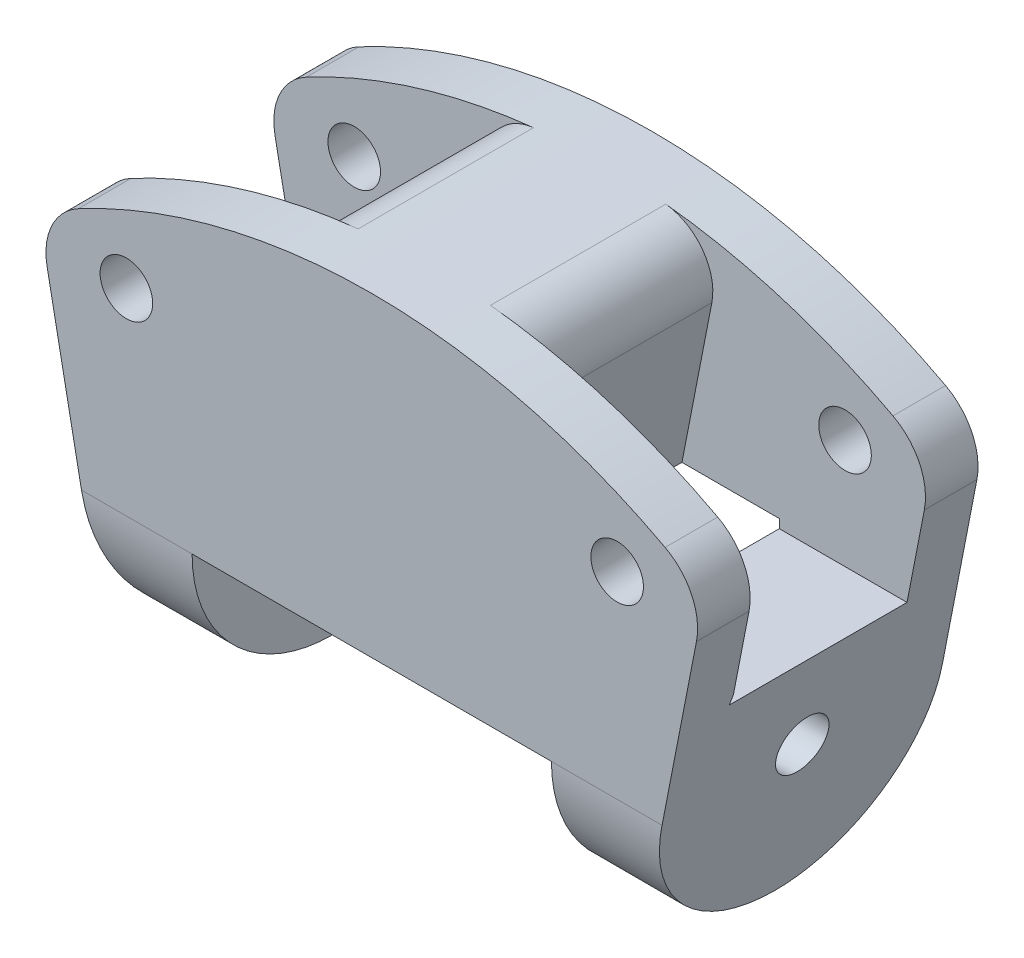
ISO-10303-21;
HEADER;
FILE_DESCRIPTION(('STEP AP214'),'2;1');
FILE_NAME('part.step','',(''),(''),'','','');
FILE_SCHEMA(('AUTOMOTIVE_DESIGN { 1 0 10303 214 1 1 1 1 }'));
ENDSEC;
DATA;
#1=APPLICATION_CONTEXT('core data for automotive mechanical design processes');
#2=APPLICATION_PROTOCOL_DEFINITION('international standard','automotive_design',2000,#1);
#3=PRODUCT_CONTEXT('',#1,'mechanical');
#4=PRODUCT('Part','Part','',(#3));
#5=PRODUCT_RELATED_PRODUCT_CATEGORY('part','',(#4));
#6=PRODUCT_DEFINITION_FORMATION('','',#4);
#7=PRODUCT_DEFINITION_CONTEXT('part definition',#1,'design');
#8=PRODUCT_DEFINITION('design','',#6,#7);
#9=PRODUCT_DEFINITION_SHAPE('','',#8);
#10=(LENGTH_UNIT() NAMED_UNIT(*) SI_UNIT(.MILLI.,.METRE.));
#11=(NAMED_UNIT(*) PLANE_ANGLE_UNIT() SI_UNIT($,.RADIAN.));
#12=(NAMED_UNIT(*) SI_UNIT($,.STERADIAN.) SOLID_ANGLE_UNIT());
#13=UNCERTAINTY_MEASURE_WITH_UNIT(LENGTH_MEASURE(1.E-05),#10,'distance_accuracy_value','');
#14=(GEOMETRIC_REPRESENTATION_CONTEXT(3) GLOBAL_UNCERTAINTY_ASSIGNED_CONTEXT((#13)) GLOBAL_UNIT_ASSIGNED_CONTEXT((#10,
#11,#12)) REPRESENTATION_CONTEXT('',''));
#15=CARTESIAN_POINT('',(0.,0.,0.));
#16=DIRECTION('',(0.,0.,1.));
#17=DIRECTION('',(1.,0.,0.));
#18=AXIS2_PLACEMENT_3D('',#15,#16,#17);
#19=CARTESIAN_POINT('',(0.,-9.5681818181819,5.));
#20=DIRECTION('',(0.,0.,1.));
#21=DIRECTION('',(1.,0.,0.));
#22=AXIS2_PLACEMENT_3D('',#19,#20,#21);
#23=PLANE('',#22);
#24=CARTESIAN_POINT('',(14.,19.25,5.));
#25=DIRECTION('',(0.,0.,1.));
#26=DIRECTION('',(1.,0.,0.));
#27=AXIS2_PLACEMENT_3D('',#24,#25,#26);
#28=CIRCLE('',#27,1.5);
#29=CARTESIAN_POINT('',(15.5,19.25,5.));
#30=VERTEX_POINT('',#29);
#31=EDGE_CURVE('E336',#30,#30,#28,.T.);
#32=ORIENTED_EDGE('',*,*,#31,.T.);
#33=EDGE_LOOP('',(#32));
#34=FACE_BOUND('',#33,.T.);
#35=DIRECTION('',(0.191510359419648,0.981490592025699,0.));
#36=VECTOR('',#35,1.);
#37=CARTESIAN_POINT('',(17.5365853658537,13.,5.));
#38=LINE('',#37,#36);
#39=CARTESIAN_POINT('',(17.6341463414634,13.5,5.));
#40=VERTEX_POINT('',#39);
#41=CARTESIAN_POINT('',(18.5235794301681,18.0583445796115,5.));
#42=VERTEX_POINT('',#41);
#43=EDGE_CURVE('E326',#40,#42,#38,.T.);
#44=ORIENTED_EDGE('',*,*,#43,.F.);
#45=DIRECTION('',(-1.,0.,0.));
#46=VECTOR('',#45,1.);
#47=CARTESIAN_POINT('',(0.,13.5000000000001,5.));
#48=LINE('',#47,#46);
#49=CARTESIAN_POINT('',(4.69670636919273,13.5,5.));
#50=VERTEX_POINT('',#49);
#51=EDGE_CURVE('E438',#40,#50,#48,.T.);
#52=ORIENTED_EDGE('',*,*,#51,.T.);
#53=DIRECTION('',(-0.191510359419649,-0.981490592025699,0.));
#54=VECTOR('',#53,1.);
#55=CARTESIAN_POINT('',(7.,25.3043798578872,5.));
#56=LINE('',#55,#54);
#57=CARTESIAN_POINT('',(6.40234187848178,22.2413819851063,5.));
#58=VERTEX_POINT('',#57);
#59=EDGE_CURVE('E317',#58,#50,#56,.T.);
#60=ORIENTED_EDGE('',*,*,#59,.F.);
#61=CARTESIAN_POINT('',(3.45787010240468,22.8159130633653,5.));
#62=DIRECTION('',(0.,0.,1.));
#63=DIRECTION('',(1.,0.,0.));
#64=AXIS2_PLACEMENT_3D('',#61,#62,#63);
#65=CIRCLE('',#64,3.);
#66=CARTESIAN_POINT('',(3.77638988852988,25.7989559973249,5.));
#67=VERTEX_POINT('',#66);
#68=EDGE_CURVE('E45',#58,#67,#65,.T.);
#69=ORIENTED_EDGE('',*,*,#68,.T.);
#70=CARTESIAN_POINT('',(0.,-9.5681818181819,5.));
#71=DIRECTION('',(0.,0.,1.));
#72=DIRECTION('',(1.,0.,0.));
#73=AXIS2_PLACEMENT_3D('',#70,#71,#72);
#74=CIRCLE('',#73,35.5681818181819);
#75=CARTESIAN_POINT('',(16.7351432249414,21.8170143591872,5.));
#76=VERTEX_POINT('',#75);
#77=EDGE_CURVE('E332',#76,#67,#74,.T.);
#78=ORIENTED_EDGE('',*,*,#77,.F.);
#79=CARTESIAN_POINT('',(15.0883623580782,18.7286308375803,5.));
#80=DIRECTION('',(0.,0.,1.));
#81=DIRECTION('',(1.,0.,0.));
#82=AXIS2_PLACEMENT_3D('',#79,#80,#81);
#83=CIRCLE('',#82,3.5);
#84=EDGE_CURVE('E328',#42,#76,#83,.T.);
#85=ORIENTED_EDGE('',*,*,#84,.F.);
#86=EDGE_LOOP('',(#44,#52,#60,#69,#78,#85));
#87=FACE_BOUND('',#86,.T.);
#88=ADVANCED_FACE('F37',(#34,#87),#23,.F.);
#89=CARTESIAN_POINT('',(-15.0883623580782,18.7286308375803,8.));
#90=DIRECTION('',(0.,0.,-1.));
#91=DIRECTION('',(-1.,0.,0.));
#92=AXIS2_PLACEMENT_3D('',#89,#90,#91);
#93=CYLINDRICAL_SURFACE('',#92,3.5);
#94=CARTESIAN_POINT('',(-15.0883623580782,18.7286308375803,5.));
#95=DIRECTION('',(0.,0.,1.));
#96=DIRECTION('',(-1.,0.,0.));
#97=AXIS2_PLACEMENT_3D('',#94,#95,#96);
#98=CIRCLE('',#97,3.5);
#99=CARTESIAN_POINT('',(-16.7351432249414,21.8170143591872,5.));
#100=VERTEX_POINT('',#99);
#101=CARTESIAN_POINT('',(-18.5235794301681,18.0583445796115,5.));
#102=VERTEX_POINT('',#101);
#103=EDGE_CURVE('E304',#100,#102,#98,.T.);
#104=ORIENTED_EDGE('',*,*,#103,.T.);
#105=DIRECTION('',(0.,0.,-1.));
#106=VECTOR('',#105,1.);
#107=CARTESIAN_POINT('',(-18.5235794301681,18.0583445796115,8.));
#108=LINE('',#107,#106);
#109=CARTESIAN_POINT('',(-18.5235794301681,18.0583445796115,8.));
#110=VERTEX_POINT('',#109);
#111=EDGE_CURVE('E391',#110,#102,#108,.T.);
#112=ORIENTED_EDGE('',*,*,#111,.F.);
#113=CARTESIAN_POINT('',(-15.0883623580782,18.7286308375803,8.));
#114=DIRECTION('',(0.,0.,1.));
#115=DIRECTION('',(1.,0.,0.));
#116=AXIS2_PLACEMENT_3D('',#113,#114,#115);
#117=CIRCLE('',#116,3.5);
#118=CARTESIAN_POINT('',(-16.7351432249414,21.8170143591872,8.));
#119=VERTEX_POINT('',#118);
#120=EDGE_CURVE('E375',#119,#110,#117,.T.);
#121=ORIENTED_EDGE('',*,*,#120,.F.);
#122=DIRECTION('',(0.,0.,-1.));
#123=VECTOR('',#122,1.);
#124=CARTESIAN_POINT('',(-16.7351432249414,21.8170143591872,8.));
#125=LINE('',#124,#123);
#126=EDGE_CURVE('E395',#119,#100,#125,.T.);
#127=ORIENTED_EDGE('',*,*,#126,.T.);
#128=EDGE_LOOP('',(#104,#112,#121,#127));
#129=FACE_BOUND('',#128,.T.);
#130=ADVANCED_FACE('F584',(#129),#93,.T.);
#131=CARTESIAN_POINT('',(-14.,19.25,8.));
#132=DIRECTION('',(0.,0.,-1.));
#133=DIRECTION('',(-1.,0.,0.));
#134=AXIS2_PLACEMENT_3D('',#131,#132,#133);
#135=CYLINDRICAL_SURFACE('',#134,1.5);
#136=CARTESIAN_POINT('',(-14.,19.25,8.));
#137=DIRECTION('',(0.,0.,1.));
#138=DIRECTION('',(1.,0.,0.));
#139=AXIS2_PLACEMENT_3D('',#136,#137,#138);
#140=CIRCLE('',#139,1.5);
#141=CARTESIAN_POINT('',(-12.5,19.25,8.));
#142=VERTEX_POINT('',#141);
#143=EDGE_CURVE('E359',#142,#142,#140,.T.);
#144=ORIENTED_EDGE('',*,*,#143,.T.);
#145=EDGE_LOOP('',(#144));
#146=FACE_BOUND('',#145,.T.);
#147=CARTESIAN_POINT('',(-14.,19.25,5.));
#148=DIRECTION('',(0.,0.,-1.));
#149=DIRECTION('',(-1.,0.,0.));
#150=AXIS2_PLACEMENT_3D('',#147,#148,#149);
#151=CIRCLE('',#150,1.5);
#152=CARTESIAN_POINT('',(-15.5,19.25,5.));
#153=VERTEX_POINT('',#152);
#154=EDGE_CURVE('E313',#153,#153,#151,.T.);
#155=ORIENTED_EDGE('',*,*,#154,.T.);
#156=EDGE_LOOP('',(#155));
#157=FACE_BOUND('',#156,.T.);
#158=ADVANCED_FACE('F589',(#146,#157),#135,.F.);
#159=CARTESIAN_POINT('',(15.,0.,8.));
#160=DIRECTION('',(-0.981490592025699,0.191510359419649,0.));
#161=DIRECTION('',(-0.191510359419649,-0.981490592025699,0.));
#162=AXIS2_PLACEMENT_3D('',#159,#160,#161);
#163=PLANE('',#162);
#164=CARTESIAN_POINT('',(16.5609756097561,8.,0.));
#165=DIRECTION('',(-0.981490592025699,0.191510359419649,0.));
#166=DIRECTION('',(-0.191510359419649,-0.981490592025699,0.));
#167=AXIS2_PLACEMENT_3D('',#164,#165,#166);
#168=ELLIPSE('',#167,1.52828770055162,1.5);
#169=CARTESIAN_POINT('',(16.2682926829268,6.5,0.));
#170=VERTEX_POINT('',#169);
#171=EDGE_CURVE('E279',#170,#170,#168,.T.);
#172=ORIENTED_EDGE('',*,*,#171,.T.);
#173=EDGE_LOOP('',(#172));
#174=FACE_BOUND('',#173,.T.);
#175=DIRECTION('',(0.,0.,1.));
#176=VECTOR('',#175,1.);
#177=CARTESIAN_POINT('',(17.5365853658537,13.,-5.));
#178=LINE('',#177,#176);
#179=CARTESIAN_POINT('',(17.5365853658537,13.,-5.));
#180=VERTEX_POINT('',#179);
#181=CARTESIAN_POINT('',(17.5365853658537,13.,5.13636363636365));
#182=VERTEX_POINT('',#181);
#183=EDGE_CURVE('E325',#180,#182,#178,.T.);
#184=ORIENTED_EDGE('',*,*,#183,.T.);
#185=DIRECTION('',(-0.184997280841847,-0.948111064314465,0.258575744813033));
#186=VECTOR('',#185,1.);
#187=CARTESIAN_POINT('',(17.0306354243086,10.4070065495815,5.84354366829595));
#188=LINE('',#187,#186);
#189=EDGE_CURVE('E446',#182,#40,#188,.F.);
#190=ORIENTED_EDGE('',*,*,#189,.T.);
#191=ORIENTED_EDGE('',*,*,#43,.T.);
#192=DIRECTION('',(0.,0.,-1.));
#193=VECTOR('',#192,1.);
#194=CARTESIAN_POINT('',(18.5235794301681,18.0583445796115,8.));
#195=LINE('',#194,#193);
#196=CARTESIAN_POINT('',(18.5235794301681,18.0583445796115,8.));
#197=VERTEX_POINT('',#196);
#198=EDGE_CURVE('E403',#197,#42,#195,.T.);
#199=ORIENTED_EDGE('',*,*,#198,.F.);
#200=DIRECTION('',(0.191510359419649,0.981490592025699,0.));
#201=VECTOR('',#200,1.);
#202=CARTESIAN_POINT('',(15.,0.,8.));
#203=LINE('',#202,#201);
#204=CARTESIAN_POINT('',(16.5609756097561,8.,8.));
#205=VERTEX_POINT('',#204);
#206=EDGE_CURVE('E368',#205,#197,#203,.T.);
#207=ORIENTED_EDGE('',*,*,#206,.F.);
#208=CARTESIAN_POINT('',(16.5609756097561,8.,0.));
#209=DIRECTION('',(-0.981490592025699,0.191510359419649,0.));
#210=DIRECTION('',(-0.191510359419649,-0.981490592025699,0.));
#211=AXIS2_PLACEMENT_3D('',#208,#209,#210);
#212=ELLIPSE('',#211,8.15086773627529,8.);
#213=CARTESIAN_POINT('',(15.,0.,0.));
#214=VERTEX_POINT('',#213);
#215=EDGE_CURVE('E406',#205,#214,#212,.F.);
#216=ORIENTED_EDGE('',*,*,#215,.T.);
#217=CARTESIAN_POINT('',(16.5609756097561,8.,0.));
#218=DIRECTION('',(-0.981490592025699,0.191510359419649,0.));
#219=DIRECTION('',(0.191510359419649,0.981490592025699,0.));
#220=AXIS2_PLACEMENT_3D('',#217,#218,#219);
#221=ELLIPSE('',#220,8.15086773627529,8.);
#222=CARTESIAN_POINT('',(16.5609756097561,8.,-8.));
#223=VERTEX_POINT('',#222);
#224=EDGE_CURVE('E408',#214,#223,#221,.F.);
#225=ORIENTED_EDGE('',*,*,#224,.T.);
#226=DIRECTION('',(0.191510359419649,0.981490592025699,0.));
#227=VECTOR('',#226,1.);
#228=CARTESIAN_POINT('',(15.,0.,-8.));
#229=LINE('',#228,#227);
#230=CARTESIAN_POINT('',(18.5235794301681,18.0583445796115,-8.));
#231=VERTEX_POINT('',#230);
#232=EDGE_CURVE('E380',#223,#231,#229,.T.);
#233=ORIENTED_EDGE('',*,*,#232,.T.);
#234=CARTESIAN_POINT('',(18.5235794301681,18.0583445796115,-5.));
#235=VERTEX_POINT('',#234);
#236=EDGE_CURVE('E402',#235,#231,#195,.T.);
#237=ORIENTED_EDGE('',*,*,#236,.F.);
#238=DIRECTION('',(0.191510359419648,0.981490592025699,0.));
#239=VECTOR('',#238,1.);
#240=CARTESIAN_POINT('',(17.5365853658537,13.,-5.));
#241=LINE('',#240,#239);
#242=EDGE_CURVE('E316',#180,#235,#241,.T.);
#243=ORIENTED_EDGE('',*,*,#242,.F.);
#244=EDGE_LOOP('',(#184,#190,#191,#199,#207,#216,#225,#233,#237,#243));
#245=FACE_BOUND('',#244,.T.);
#246=ADVANCED_FACE('F541',(#174,#245),#163,.F.);
#247=CARTESIAN_POINT('',(15.0883623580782,18.7286308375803,8.));
#248=DIRECTION('',(0.,0.,-1.));
#249=DIRECTION('',(-1.,0.,0.));
#250=AXIS2_PLACEMENT_3D('',#247,#248,#249);
#251=CYLINDRICAL_SURFACE('',#250,3.5);
#252=CARTESIAN_POINT('',(15.0883623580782,18.7286308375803,-5.));
#253=DIRECTION('',(0.,0.,1.));
#254=DIRECTION('',(1.,0.,0.));
#255=AXIS2_PLACEMENT_3D('',#252,#253,#254);
#256=CIRCLE('',#255,3.5);
#257=CARTESIAN_POINT('',(16.7351432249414,21.8170143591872,-5.));
#258=VERTEX_POINT('',#257);
#259=EDGE_CURVE('E319',#235,#258,#256,.T.);
#260=ORIENTED_EDGE('',*,*,#259,.F.);
#261=ORIENTED_EDGE('',*,*,#236,.T.);
#262=CARTESIAN_POINT('',(15.0883623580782,18.7286308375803,-8.));
#263=DIRECTION('',(0.,0.,1.));
#264=DIRECTION('',(1.,0.,0.));
#265=AXIS2_PLACEMENT_3D('',#262,#263,#264);
#266=CIRCLE('',#265,3.5);
#267=CARTESIAN_POINT('',(16.7351432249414,21.8170143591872,-8.));
#268=VERTEX_POINT('',#267);
#269=EDGE_CURVE('E383',#231,#268,#266,.T.);
#270=ORIENTED_EDGE('',*,*,#269,.T.);
#271=DIRECTION('',(0.,0.,-1.));
#272=VECTOR('',#271,1.);
#273=CARTESIAN_POINT('',(16.7351432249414,21.8170143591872,8.));
#274=LINE('',#273,#272);
#275=EDGE_CURVE('E398',#258,#268,#274,.T.);
#276=ORIENTED_EDGE('',*,*,#275,.F.);
#277=EDGE_LOOP('',(#260,#261,#270,#276));
#278=FACE_BOUND('',#277,.T.);
#279=ADVANCED_FACE('F538',(#278),#251,.T.);
#280=CARTESIAN_POINT('',(0.,-9.5681818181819,8.));
#281=DIRECTION('',(0.,0.,-1.));
#282=DIRECTION('',(-1.,0.,0.));
#283=AXIS2_PLACEMENT_3D('',#280,#281,#282);
#284=CYLINDRICAL_SURFACE('',#283,35.5681818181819);
#285=DIRECTION('',(0.,0.,-1.));
#286=VECTOR('',#285,1.);
#287=CARTESIAN_POINT('',(-3.77638988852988,25.7989559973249,8.));
#288=LINE('',#287,#286);
#289=CARTESIAN_POINT('',(-3.77638988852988,25.7989559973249,-5.));
#290=VERTEX_POINT('',#289);
#291=CARTESIAN_POINT('',(-3.77638988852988,25.7989559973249,5.));
#292=VERTEX_POINT('',#291);
#293=EDGE_CURVE('E462',#290,#292,#288,.F.);
#294=ORIENTED_EDGE('',*,*,#293,.T.);
#295=CARTESIAN_POINT('',(0.,-9.5681818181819,5.));
#296=DIRECTION('',(0.,0.,1.));
#297=DIRECTION('',(-1.,0.,0.));
#298=AXIS2_PLACEMENT_3D('',#295,#296,#297);
#299=CIRCLE('',#298,35.5681818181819);
#300=EDGE_CURVE('E286',#292,#100,#299,.T.);
#301=ORIENTED_EDGE('',*,*,#300,.T.);
#302=ORIENTED_EDGE('',*,*,#126,.F.);
#303=CARTESIAN_POINT('',(0.,-9.5681818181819,8.));
#304=DIRECTION('',(0.,0.,1.));
#305=DIRECTION('',(1.,0.,0.));
#306=AXIS2_PLACEMENT_3D('',#303,#304,#305);
#307=CIRCLE('',#306,35.5681818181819);
#308=CARTESIAN_POINT('',(16.7351432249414,21.8170143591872,8.));
#309=VERTEX_POINT('',#308);
#310=EDGE_CURVE('E373',#309,#119,#307,.T.);
#311=ORIENTED_EDGE('',*,*,#310,.F.);
#312=EDGE_CURVE('E399',#309,#76,#274,.T.);
#313=ORIENTED_EDGE('',*,*,#312,.T.);
#314=ORIENTED_EDGE('',*,*,#77,.T.);
#315=DIRECTION('',(0.,0.,-1.));
#316=VECTOR('',#315,1.);
#317=CARTESIAN_POINT('',(3.77638988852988,25.7989559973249,8.));
#318=LINE('',#317,#316);
#319=CARTESIAN_POINT('',(3.77638988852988,25.7989559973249,-5.));
#320=VERTEX_POINT('',#319);
#321=EDGE_CURVE('E459',#67,#320,#318,.T.);
#322=ORIENTED_EDGE('',*,*,#321,.T.);
#323=CARTESIAN_POINT('',(0.,-9.5681818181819,-5.));
#324=DIRECTION('',(0.,0.,1.));
#325=DIRECTION('',(1.,0.,0.));
#326=AXIS2_PLACEMENT_3D('',#323,#324,#325);
#327=CIRCLE('',#326,35.5681818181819);
#328=EDGE_CURVE('E321',#258,#320,#327,.T.);
#329=ORIENTED_EDGE('',*,*,#328,.F.);
#330=ORIENTED_EDGE('',*,*,#275,.T.);
#331=CARTESIAN_POINT('',(0.,-9.5681818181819,-8.));
#332=DIRECTION('',(0.,0.,1.));
#333=DIRECTION('',(1.,0.,0.));
#334=AXIS2_PLACEMENT_3D('',#331,#332,#333);
#335=CIRCLE('',#334,35.5681818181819);
#336=CARTESIAN_POINT('',(-16.7351432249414,21.8170143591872,-8.));
#337=VERTEX_POINT('',#336);
#338=EDGE_CURVE('E386',#268,#337,#335,.T.);
#339=ORIENTED_EDGE('',*,*,#338,.T.);
#340=CARTESIAN_POINT('',(-16.7351432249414,21.8170143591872,-5.));
#341=VERTEX_POINT('',#340);
#342=EDGE_CURVE('E394',#341,#337,#125,.T.);
#343=ORIENTED_EDGE('',*,*,#342,.F.);
#344=CARTESIAN_POINT('',(0.,-9.5681818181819,-5.));
#345=DIRECTION('',(0.,0.,1.));
#346=DIRECTION('',(-1.,0.,0.));
#347=AXIS2_PLACEMENT_3D('',#344,#345,#346);
#348=CIRCLE('',#347,35.5681818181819);
#349=EDGE_CURVE('E287',#290,#341,#348,.T.);
#350=ORIENTED_EDGE('',*,*,#349,.F.);
#351=EDGE_LOOP('',(#294,#301,#302,#311,#313,#314,#322,#329,#330,#339,#343,#350));
#352=FACE_BOUND('',#351,.T.);
#353=ADVANCED_FACE('F479',(#352),#284,.T.);
#354=CARTESIAN_POINT('',(14.,19.25,8.));
#355=DIRECTION('',(0.,0.,-1.));
#356=DIRECTION('',(-1.,0.,0.));
#357=AXIS2_PLACEMENT_3D('',#354,#355,#356);
#358=CYLINDRICAL_SURFACE('',#357,1.5);
#359=CARTESIAN_POINT('',(14.,19.25,-8.));
#360=DIRECTION('',(0.,0.,1.));
#361=DIRECTION('',(-1.,0.,0.));
#362=AXIS2_PLACEMENT_3D('',#359,#360,#361);
#363=CIRCLE('',#362,1.5);
#364=CARTESIAN_POINT('',(12.5,19.25,-8.));
#365=VERTEX_POINT('',#364);
#366=EDGE_CURVE('E355',#365,#365,#363,.T.);
#367=ORIENTED_EDGE('',*,*,#366,.F.);
#368=EDGE_LOOP('',(#367));
#369=FACE_BOUND('',#368,.T.);
#370=CARTESIAN_POINT('',(14.,19.25,-5.));
#371=DIRECTION('',(0.,0.,1.));
#372=DIRECTION('',(1.,0.,0.));
#373=AXIS2_PLACEMENT_3D('',#370,#371,#372);
#374=CIRCLE('',#373,1.5);
#375=CARTESIAN_POINT('',(15.5,19.25,-5.));
#376=VERTEX_POINT('',#375);
#377=EDGE_CURVE('E342',#376,#376,#374,.T.);
#378=ORIENTED_EDGE('',*,*,#377,.T.);
#379=EDGE_LOOP('',(#378));
#380=FACE_BOUND('',#379,.T.);
#381=ADVANCED_FACE('F635',(#369,#380),#358,.F.);
#382=CARTESIAN_POINT('',(-15.0883623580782,8.,0.));
#383=DIRECTION('',(-1.,0.,0.));
#384=DIRECTION('',(0.,0.,1.));
#385=AXIS2_PLACEMENT_3D('',#382,#383,#384);
#386=CYLINDRICAL_SURFACE('',#385,8.);
#387=CARTESIAN_POINT('',(10.25,8.,0.));
#388=DIRECTION('',(1.,0.,0.));
#389=DIRECTION('',(0.,0.,-1.));
#390=AXIS2_PLACEMENT_3D('',#387,#388,#389);
#391=CIRCLE('',#390,8.);
#392=CARTESIAN_POINT('',(10.25,0.,0.));
#393=VERTEX_POINT('',#392);
#394=CARTESIAN_POINT('',(10.25,8.,8.));
#395=VERTEX_POINT('',#394);
#396=EDGE_CURVE('E347',#393,#395,#391,.F.);
#397=ORIENTED_EDGE('',*,*,#396,.F.);
#398=DIRECTION('',(1.,0.,0.));
#399=VECTOR('',#398,1.);
#400=CARTESIAN_POINT('',(-15.,0.,0.));
#401=LINE('',#400,#399);
#402=EDGE_CURVE('E358',#214,#393,#401,.F.);
#403=ORIENTED_EDGE('',*,*,#402,.F.);
#404=ORIENTED_EDGE('',*,*,#215,.F.);
#405=DIRECTION('',(1.,0.,0.));
#406=VECTOR('',#405,1.);
#407=CARTESIAN_POINT('',(15.,8.,8.));
#408=LINE('',#407,#406);
#409=EDGE_CURVE('E417',#395,#205,#408,.T.);
#410=ORIENTED_EDGE('',*,*,#409,.F.);
#411=EDGE_LOOP('',(#397,#403,#404,#410));
#412=FACE_BOUND('',#411,.T.);
#413=ADVANCED_FACE('F549',(#412),#386,.T.);
#414=CARTESIAN_POINT('',(15.,8.,0.));
#415=DIRECTION('',(1.,0.,0.));
#416=DIRECTION('',(0.,0.,-1.));
#417=AXIS2_PLACEMENT_3D('',#414,#415,#416);
#418=CYLINDRICAL_SURFACE('',#417,8.);
#419=CARTESIAN_POINT('',(10.25,8.,0.));
#420=DIRECTION('',(1.,0.,0.));
#421=DIRECTION('',(0.,0.,-1.));
#422=AXIS2_PLACEMENT_3D('',#419,#420,#421);
#423=CIRCLE('',#422,8.);
#424=CARTESIAN_POINT('',(10.25,8.,-8.));
#425=VERTEX_POINT('',#424);
#426=EDGE_CURVE('E426',#425,#393,#423,.F.);
#427=ORIENTED_EDGE('',*,*,#426,.F.);
#428=DIRECTION('',(1.,0.,0.));
#429=VECTOR('',#428,1.);
#430=CARTESIAN_POINT('',(-15.0883623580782,8.,-8.));
#431=LINE('',#430,#429);
#432=EDGE_CURVE('E248',#223,#425,#431,.F.);
#433=ORIENTED_EDGE('',*,*,#432,.F.);
#434=ORIENTED_EDGE('',*,*,#224,.F.);
#435=ORIENTED_EDGE('',*,*,#402,.T.);
#436=EDGE_LOOP('',(#427,#433,#434,#435));
#437=FACE_BOUND('',#436,.T.);
#438=ADVANCED_FACE('F544',(#437),#418,.T.);
#439=CARTESIAN_POINT('',(-15.0883623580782,18.7286308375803,8.));
#440=DIRECTION('',(0.,0.,1.));
#441=DIRECTION('',(1.,0.,0.));
#442=AXIS2_PLACEMENT_3D('',#439,#440,#441);
#443=PLANE('',#442);
#444=ORIENTED_EDGE('',*,*,#143,.F.);
#445=EDGE_LOOP('',(#444));
#446=FACE_BOUND('',#445,.T.);
#447=DIRECTION('',(0.191510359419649,-0.981490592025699,0.));
#448=VECTOR('',#447,1.);
#449=CARTESIAN_POINT('',(-15.,0.,8.));
#450=LINE('',#449,#448);
#451=CARTESIAN_POINT('',(-16.5609756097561,8.,8.));
#452=VERTEX_POINT('',#451);
#453=EDGE_CURVE('E365',#110,#452,#450,.T.);
#454=ORIENTED_EDGE('',*,*,#453,.T.);
#455=CARTESIAN_POINT('',(-10.25,7.99999999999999,8.));
#456=VERTEX_POINT('',#455);
#457=EDGE_CURVE('E418',#452,#456,#408,.T.);
#458=ORIENTED_EDGE('',*,*,#457,.T.);
#459=DIRECTION('',(-1.,0.,0.));
#460=VECTOR('',#459,1.);
#461=CARTESIAN_POINT('',(-15.0883623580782,7.99999999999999,8.));
#462=LINE('',#461,#460);
#463=EDGE_CURVE('E339',#395,#456,#462,.T.);
#464=ORIENTED_EDGE('',*,*,#463,.F.);
#465=ORIENTED_EDGE('',*,*,#409,.T.);
#466=ORIENTED_EDGE('',*,*,#206,.T.);
#467=CARTESIAN_POINT('',(15.0883623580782,18.7286308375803,8.));
#468=DIRECTION('',(0.,0.,1.));
#469=DIRECTION('',(1.,0.,0.));
#470=AXIS2_PLACEMENT_3D('',#467,#468,#469);
#471=CIRCLE('',#470,3.5);
#472=EDGE_CURVE('E371',#197,#309,#471,.T.);
#473=ORIENTED_EDGE('',*,*,#472,.T.);
#474=ORIENTED_EDGE('',*,*,#310,.T.);
#475=ORIENTED_EDGE('',*,*,#120,.T.);
#476=EDGE_LOOP('',(#454,#458,#464,#465,#466,#473,#474,#475));
#477=FACE_BOUND('',#476,.T.);
#478=CARTESIAN_POINT('',(14.,19.25,8.));
#479=DIRECTION('',(0.,0.,1.));
#480=DIRECTION('',(-1.,0.,0.));
#481=AXIS2_PLACEMENT_3D('',#478,#479,#480);
#482=CIRCLE('',#481,1.5);
#483=CARTESIAN_POINT('',(12.5,19.25,8.));
#484=VERTEX_POINT('',#483);
#485=EDGE_CURVE('E351',#484,#484,#482,.T.);
#486=ORIENTED_EDGE('',*,*,#485,.F.);
#487=EDGE_LOOP('',(#486));
#488=FACE_BOUND('',#487,.T.);
#489=ADVANCED_FACE('F554',(#446,#477,#488),#443,.T.);
#490=CARTESIAN_POINT('',(-15.0883623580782,18.7286308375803,-8.));
#491=DIRECTION('',(0.,0.,1.));
#492=DIRECTION('',(1.,0.,0.));
#493=AXIS2_PLACEMENT_3D('',#490,#491,#492);
#494=PLANE('',#493);
#495=CARTESIAN_POINT('',(-14.,19.25,-8.));
#496=DIRECTION('',(0.,0.,1.));
#497=DIRECTION('',(1.,0.,0.));
#498=AXIS2_PLACEMENT_3D('',#495,#496,#497);
#499=CIRCLE('',#498,1.5);
#500=CARTESIAN_POINT('',(-12.5,19.25,-8.));
#501=VERTEX_POINT('',#500);
#502=EDGE_CURVE('E354',#501,#501,#499,.T.);
#503=ORIENTED_EDGE('',*,*,#502,.T.);
#504=EDGE_LOOP('',(#503));
#505=FACE_BOUND('',#504,.T.);
#506=DIRECTION('',(1.,0.,0.));
#507=VECTOR('',#506,1.);
#508=CARTESIAN_POINT('',(10.25,13.5,-8.));
#509=LINE('',#508,#507);
#510=CARTESIAN_POINT('',(-10.25,13.5,-8.));
#511=VERTEX_POINT('',#510);
#512=CARTESIAN_POINT('',(10.25,13.5,-8.));
#513=VERTEX_POINT('',#512);
#514=EDGE_CURVE('E235',#511,#513,#509,.T.);
#515=ORIENTED_EDGE('',*,*,#514,.F.);
#516=DIRECTION('',(0.,1.,0.));
#517=VECTOR('',#516,1.);
#518=CARTESIAN_POINT('',(-10.25,13.5,-8.));
#519=LINE('',#518,#517);
#520=CARTESIAN_POINT('',(-10.25,8.,-8.));
#521=VERTEX_POINT('',#520);
#522=EDGE_CURVE('E241',#521,#511,#519,.T.);
#523=ORIENTED_EDGE('',*,*,#522,.F.);
#524=CARTESIAN_POINT('',(-16.5609756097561,8.,-8.));
#525=VERTEX_POINT('',#524);
#526=EDGE_CURVE('E410',#521,#525,#431,.F.);
#527=ORIENTED_EDGE('',*,*,#526,.T.);
#528=DIRECTION('',(0.191510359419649,-0.981490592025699,0.));
#529=VECTOR('',#528,1.);
#530=CARTESIAN_POINT('',(-15.,0.,-8.));
#531=LINE('',#530,#529);
#532=CARTESIAN_POINT('',(-18.5235794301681,18.0583445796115,-8.));
#533=VERTEX_POINT('',#532);
#534=EDGE_CURVE('E362',#533,#525,#531,.T.);
#535=ORIENTED_EDGE('',*,*,#534,.F.);
#536=CARTESIAN_POINT('',(-15.0883623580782,18.7286308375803,-8.));
#537=DIRECTION('',(0.,0.,1.));
#538=DIRECTION('',(1.,0.,0.));
#539=AXIS2_PLACEMENT_3D('',#536,#537,#538);
#540=CIRCLE('',#539,3.5);
#541=EDGE_CURVE('E369',#337,#533,#540,.T.);
#542=ORIENTED_EDGE('',*,*,#541,.F.);
#543=ORIENTED_EDGE('',*,*,#338,.F.);
#544=ORIENTED_EDGE('',*,*,#269,.F.);
#545=ORIENTED_EDGE('',*,*,#232,.F.);
#546=ORIENTED_EDGE('',*,*,#432,.T.);
#547=DIRECTION('',(0.,-1.,0.));
#548=VECTOR('',#547,1.);
#549=CARTESIAN_POINT('',(10.25,8.,-8.));
#550=LINE('',#549,#548);
#551=EDGE_CURVE('E225',#513,#425,#550,.T.);
#552=ORIENTED_EDGE('',*,*,#551,.F.);
#553=EDGE_LOOP('',(#515,#523,#527,#535,#542,#543,#544,#545,#546,#552));
#554=FACE_BOUND('',#553,.T.);
#555=ORIENTED_EDGE('',*,*,#366,.T.);
#556=EDGE_LOOP('',(#555));
#557=FACE_BOUND('',#556,.T.);
#558=ADVANCED_FACE('F244',(#505,#554,#557),#494,.F.);
#559=CARTESIAN_POINT('',(-15.,0.,8.));
#560=DIRECTION('',(0.981490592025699,0.191510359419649,0.));
#561=DIRECTION('',(-0.191510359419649,0.981490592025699,0.));
#562=AXIS2_PLACEMENT_3D('',#559,#560,#561);
#563=PLANE('',#562);
#564=CARTESIAN_POINT('',(-16.5609756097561,8.,0.));
#565=DIRECTION('',(0.981490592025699,0.191510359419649,0.));
#566=DIRECTION('',(-0.191510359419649,0.981490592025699,0.));
#567=AXIS2_PLACEMENT_3D('',#564,#565,#566);
#568=ELLIPSE('',#567,1.52828770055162,1.5);
#569=CARTESIAN_POINT('',(-16.8536585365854,9.5,0.));
#570=VERTEX_POINT('',#569);
#571=EDGE_CURVE('E276',#570,#570,#568,.T.);
#572=ORIENTED_EDGE('',*,*,#571,.T.);
#573=EDGE_LOOP('',(#572));
#574=FACE_BOUND('',#573,.T.);
#575=DIRECTION('',(-0.184997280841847,0.948111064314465,-0.258575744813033));
#576=VECTOR('',#575,1.);
#577=CARTESIAN_POINT('',(-17.0306354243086,10.4070065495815,5.84354366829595));
#578=LINE('',#577,#576);
#579=CARTESIAN_POINT('',(-17.6341463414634,13.5,5.));
#580=VERTEX_POINT('',#579);
#581=CARTESIAN_POINT('',(-17.5365853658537,13.,5.13636363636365));
#582=VERTEX_POINT('',#581);
#583=EDGE_CURVE('E441',#580,#582,#578,.F.);
#584=ORIENTED_EDGE('',*,*,#583,.T.);
#585=DIRECTION('',(0.,0.,1.));
#586=VECTOR('',#585,1.);
#587=CARTESIAN_POINT('',(-17.5365853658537,13.,-5.));
#588=LINE('',#587,#586);
#589=CARTESIAN_POINT('',(-17.5365853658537,13.,-5.));
#590=VERTEX_POINT('',#589);
#591=EDGE_CURVE('E301',#590,#582,#588,.T.);
#592=ORIENTED_EDGE('',*,*,#591,.F.);
#593=DIRECTION('',(0.191510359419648,-0.981490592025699,0.));
#594=VECTOR('',#593,1.);
#595=CARTESIAN_POINT('',(-17.5365853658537,13.,-5.));
#596=LINE('',#595,#594);
#597=CARTESIAN_POINT('',(-18.5235794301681,18.0583445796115,-5.));
#598=VERTEX_POINT('',#597);
#599=EDGE_CURVE('E292',#598,#590,#596,.T.);
#600=ORIENTED_EDGE('',*,*,#599,.F.);
#601=EDGE_CURVE('E377',#598,#533,#108,.T.);
#602=ORIENTED_EDGE('',*,*,#601,.T.);
#603=ORIENTED_EDGE('',*,*,#534,.T.);
#604=CARTESIAN_POINT('',(-16.5609756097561,8.,0.));
#605=DIRECTION('',(0.981490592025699,0.191510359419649,0.));
#606=DIRECTION('',(0.191510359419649,-0.981490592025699,0.));
#607=AXIS2_PLACEMENT_3D('',#604,#605,#606);
#608=ELLIPSE('',#607,8.15086773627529,8.);
#609=CARTESIAN_POINT('',(-15.,0.,0.));
#610=VERTEX_POINT('',#609);
#611=EDGE_CURVE('E414',#525,#610,#608,.F.);
#612=ORIENTED_EDGE('',*,*,#611,.T.);
#613=CARTESIAN_POINT('',(-16.5609756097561,8.,0.));
#614=DIRECTION('',(0.981490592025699,0.191510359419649,0.));
#615=DIRECTION('',(-0.191510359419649,0.981490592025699,0.));
#616=AXIS2_PLACEMENT_3D('',#613,#614,#615);
#617=ELLIPSE('',#616,8.15086773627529,8.);
#618=EDGE_CURVE('E412',#610,#452,#617,.F.);
#619=ORIENTED_EDGE('',*,*,#618,.T.);
#620=ORIENTED_EDGE('',*,*,#453,.F.);
#621=ORIENTED_EDGE('',*,*,#111,.T.);
#622=DIRECTION('',(0.191510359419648,-0.981490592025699,0.));
#623=VECTOR('',#622,1.);
#624=CARTESIAN_POINT('',(-17.5365853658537,13.,5.));
#625=LINE('',#624,#623);
#626=EDGE_CURVE('E307',#102,#580,#625,.T.);
#627=ORIENTED_EDGE('',*,*,#626,.T.);
#628=EDGE_LOOP('',(#584,#592,#600,#602,#603,#612,#619,#620,#621,#627));
#629=FACE_BOUND('',#628,.T.);
#630=ADVANCED_FACE('F528',(#574,#629),#563,.F.);
#631=ORIENTED_EDGE('',*,*,#198,.T.);
#632=ORIENTED_EDGE('',*,*,#84,.T.);
#633=ORIENTED_EDGE('',*,*,#312,.F.);
#634=ORIENTED_EDGE('',*,*,#472,.F.);
#635=EDGE_LOOP('',(#631,#632,#633,#634));
#636=FACE_BOUND('',#635,.T.);
#637=ADVANCED_FACE('F486',(#636),#251,.T.);
#638=ORIENTED_EDGE('',*,*,#601,.F.);
#639=CARTESIAN_POINT('',(-15.0883623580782,18.7286308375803,-5.));
#640=DIRECTION('',(0.,0.,1.));
#641=DIRECTION('',(-1.,0.,0.));
#642=AXIS2_PLACEMENT_3D('',#639,#640,#641);
#643=CIRCLE('',#642,3.5);
#644=EDGE_CURVE('E289',#341,#598,#643,.T.);
#645=ORIENTED_EDGE('',*,*,#644,.F.);
#646=ORIENTED_EDGE('',*,*,#342,.T.);
#647=ORIENTED_EDGE('',*,*,#541,.T.);
#648=EDGE_LOOP('',(#638,#645,#646,#647));
#649=FACE_BOUND('',#648,.T.);
#650=ADVANCED_FACE('F533',(#649),#93,.T.);
#651=CARTESIAN_POINT('',(-14.,19.25,-5.));
#652=DIRECTION('',(0.,0.,-1.));
#653=DIRECTION('',(-1.,0.,0.));
#654=AXIS2_PLACEMENT_3D('',#651,#652,#653);
#655=CIRCLE('',#654,1.5);
#656=CARTESIAN_POINT('',(-15.5,19.25,-5.));
#657=VERTEX_POINT('',#656);
#658=EDGE_CURVE('E329',#657,#657,#655,.T.);
#659=ORIENTED_EDGE('',*,*,#658,.F.);
#660=EDGE_LOOP('',(#659));
#661=FACE_BOUND('',#660,.T.);
#662=ORIENTED_EDGE('',*,*,#502,.F.);
#663=EDGE_LOOP('',(#662));
#664=FACE_BOUND('',#663,.T.);
#665=ADVANCED_FACE('F638',(#661,#664),#135,.F.);
#666=ORIENTED_EDGE('',*,*,#31,.F.);
#667=EDGE_LOOP('',(#666));
#668=FACE_BOUND('',#667,.T.);
#669=ORIENTED_EDGE('',*,*,#485,.T.);
#670=EDGE_LOOP('',(#669));
#671=FACE_BOUND('',#670,.T.);
#672=ADVANCED_FACE('F623',(#668,#671),#358,.F.);
#673=CARTESIAN_POINT('',(-10.25,8.,0.));
#674=DIRECTION('',(-1.,0.,0.));
#675=DIRECTION('',(0.,-1.,0.));
#676=AXIS2_PLACEMENT_3D('',#673,#674,#675);
#677=CIRCLE('',#676,8.);
#678=CARTESIAN_POINT('',(-10.25,0.,0.));
#679=VERTEX_POINT('',#678);
#680=EDGE_CURVE('E345',#456,#679,#677,.F.);
#681=ORIENTED_EDGE('',*,*,#680,.F.);
#682=ORIENTED_EDGE('',*,*,#457,.F.);
#683=ORIENTED_EDGE('',*,*,#618,.F.);
#684=EDGE_CURVE('E350',#679,#610,#401,.F.);
#685=ORIENTED_EDGE('',*,*,#684,.F.);
#686=EDGE_LOOP('',(#681,#682,#683,#685));
#687=FACE_BOUND('',#686,.T.);
#688=ADVANCED_FACE('F563',(#687),#386,.T.);
#689=CARTESIAN_POINT('',(-10.25,8.,0.));
#690=DIRECTION('',(-1.,0.,0.));
#691=DIRECTION('',(0.,-1.,0.));
#692=AXIS2_PLACEMENT_3D('',#689,#690,#691);
#693=CIRCLE('',#692,8.);
#694=EDGE_CURVE('E421',#679,#521,#693,.F.);
#695=ORIENTED_EDGE('',*,*,#694,.F.);
#696=ORIENTED_EDGE('',*,*,#684,.T.);
#697=ORIENTED_EDGE('',*,*,#611,.F.);
#698=ORIENTED_EDGE('',*,*,#526,.F.);
#699=EDGE_LOOP('',(#695,#696,#697,#698));
#700=FACE_BOUND('',#699,.T.);
#701=ADVANCED_FACE('F524',(#700),#418,.T.);
#702=CARTESIAN_POINT('',(10.25,-0.937448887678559,-10.));
#703=DIRECTION('',(1.,0.,0.));
#704=DIRECTION('',(0.,0.,-1.));
#705=AXIS2_PLACEMENT_3D('',#702,#703,#704);
#706=PLANE('',#705);
#707=CARTESIAN_POINT('',(10.25,8.,0.));
#708=DIRECTION('',(1.,0.,0.));
#709=DIRECTION('',(0.,0.,-1.));
#710=AXIS2_PLACEMENT_3D('',#707,#708,#709);
#711=CIRCLE('',#710,1.5);
#712=CARTESIAN_POINT('',(10.25,8.,-1.5));
#713=VERTEX_POINT('',#712);
#714=EDGE_CURVE('E273',#713,#713,#711,.T.);
#715=ORIENTED_EDGE('',*,*,#714,.T.);
#716=EDGE_LOOP('',(#715));
#717=FACE_BOUND('',#716,.T.);
#718=DIRECTION('',(0.,0.,1.));
#719=VECTOR('',#718,1.);
#720=CARTESIAN_POINT('',(10.25,8.,-10.));
#721=LINE('',#720,#719);
#722=CARTESIAN_POINT('',(10.25,8.,6.5));
#723=VERTEX_POINT('',#722);
#724=EDGE_CURVE('E340',#723,#395,#721,.T.);
#725=ORIENTED_EDGE('',*,*,#724,.F.);
#726=DIRECTION('',(0.,-0.964763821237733,0.263117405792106));
#727=VECTOR('',#726,1.);
#728=CARTESIAN_POINT('',(10.25,3.86975911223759,7.6264293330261));
#729=LINE('',#728,#727);
#730=CARTESIAN_POINT('',(10.25,13.,5.13636363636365));
#731=VERTEX_POINT('',#730);
#732=EDGE_CURVE('E453',#723,#731,#729,.F.);
#733=ORIENTED_EDGE('',*,*,#732,.T.);
#734=DIRECTION('',(0.,0.,-1.));
#735=VECTOR('',#734,1.);
#736=CARTESIAN_POINT('',(10.25,13.,-5.));
#737=LINE('',#736,#735);
#738=CARTESIAN_POINT('',(10.25,13.,-5.));
#739=VERTEX_POINT('',#738);
#740=EDGE_CURVE('E284',#731,#739,#737,.T.);
#741=ORIENTED_EDGE('',*,*,#740,.T.);
#742=DIRECTION('',(0.,1.,0.));
#743=VECTOR('',#742,1.);
#744=CARTESIAN_POINT('',(10.25,-9.5681818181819,-5.));
#745=LINE('',#744,#743);
#746=CARTESIAN_POINT('',(10.25,13.5,-5.));
#747=VERTEX_POINT('',#746);
#748=EDGE_CURVE('E228',#739,#747,#745,.T.);
#749=ORIENTED_EDGE('',*,*,#748,.T.);
#750=DIRECTION('',(0.,0.,-1.));
#751=VECTOR('',#750,1.);
#752=CARTESIAN_POINT('',(10.25,13.5,26.2249852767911));
#753=LINE('',#752,#751);
#754=EDGE_CURVE('E220',#747,#513,#753,.T.);
#755=ORIENTED_EDGE('',*,*,#754,.T.);
#756=ORIENTED_EDGE('',*,*,#551,.T.);
#757=ORIENTED_EDGE('',*,*,#426,.T.);
#758=ORIENTED_EDGE('',*,*,#396,.T.);
#759=EDGE_LOOP('',(#725,#733,#741,#749,#755,#756,#757,#758));
#760=FACE_BOUND('',#759,.T.);
#761=ADVANCED_FACE('F223',(#717,#760),#706,.F.);
#762=CARTESIAN_POINT('',(-10.25,-0.93744888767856,-10.));
#763=DIRECTION('',(-1.,0.,0.));
#764=DIRECTION('',(0.,-1.,0.));
#765=AXIS2_PLACEMENT_3D('',#762,#763,#764);
#766=PLANE('',#765);
#767=CARTESIAN_POINT('',(-10.25,8.,0.));
#768=DIRECTION('',(-1.,0.,0.));
#769=DIRECTION('',(0.,-1.,0.));
#770=AXIS2_PLACEMENT_3D('',#767,#768,#769);
#771=CIRCLE('',#770,1.5);
#772=CARTESIAN_POINT('',(-10.25,6.5,0.));
#773=VERTEX_POINT('',#772);
#774=EDGE_CURVE('E270',#773,#773,#771,.T.);
#775=ORIENTED_EDGE('',*,*,#774,.T.);
#776=EDGE_LOOP('',(#775));
#777=FACE_BOUND('',#776,.T.);
#778=ORIENTED_EDGE('',*,*,#694,.T.);
#779=ORIENTED_EDGE('',*,*,#522,.T.);
#780=DIRECTION('',(0.,0.,-1.));
#781=VECTOR('',#780,1.);
#782=CARTESIAN_POINT('',(-10.25,13.5,26.2249852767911));
#783=LINE('',#782,#781);
#784=CARTESIAN_POINT('',(-10.25,13.5,-5.));
#785=VERTEX_POINT('',#784);
#786=EDGE_CURVE('E238',#785,#511,#783,.T.);
#787=ORIENTED_EDGE('',*,*,#786,.F.);
#788=DIRECTION('',(0.,1.,0.));
#789=VECTOR('',#788,1.);
#790=CARTESIAN_POINT('',(-10.25,-9.5681818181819,-5.));
#791=LINE('',#790,#789);
#792=CARTESIAN_POINT('',(-10.25,13.,-5.));
#793=VERTEX_POINT('',#792);
#794=EDGE_CURVE('E256',#793,#785,#791,.T.);
#795=ORIENTED_EDGE('',*,*,#794,.F.);
#796=DIRECTION('',(0.,0.,1.));
#797=VECTOR('',#796,1.);
#798=CARTESIAN_POINT('',(-10.25,13.,-5.));
#799=LINE('',#798,#797);
#800=CARTESIAN_POINT('',(-10.25,13.,5.13636363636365));
#801=VERTEX_POINT('',#800);
#802=EDGE_CURVE('E282',#793,#801,#799,.T.);
#803=ORIENTED_EDGE('',*,*,#802,.T.);
#804=DIRECTION('',(0.,0.964763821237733,-0.263117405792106));
#805=VECTOR('',#804,1.);
#806=CARTESIAN_POINT('',(-10.25,3.86975911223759,7.62642933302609));
#807=LINE('',#806,#805);
#808=CARTESIAN_POINT('',(-10.25,7.99999999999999,6.5));
#809=VERTEX_POINT('',#808);
#810=EDGE_CURVE('E451',#801,#809,#807,.F.);
#811=ORIENTED_EDGE('',*,*,#810,.T.);
#812=DIRECTION('',(0.,0.,1.));
#813=VECTOR('',#812,1.);
#814=CARTESIAN_POINT('',(-10.25,7.99999999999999,-10.));
#815=LINE('',#814,#813);
#816=EDGE_CURVE('E337',#809,#456,#815,.T.);
#817=ORIENTED_EDGE('',*,*,#816,.T.);
#818=ORIENTED_EDGE('',*,*,#680,.T.);
#819=EDGE_LOOP('',(#778,#779,#787,#795,#803,#811,#817,#818));
#820=FACE_BOUND('',#819,.T.);
#821=ADVANCED_FACE('F516',(#777,#820),#766,.F.);
#822=CARTESIAN_POINT('',(10.25,8.,-10.));
#823=DIRECTION('',(0.,1.,0.));
#824=DIRECTION('',(-1.,0.,0.));
#825=AXIS2_PLACEMENT_3D('',#822,#823,#824);
#826=PLANE('',#825);
#827=ORIENTED_EDGE('',*,*,#816,.F.);
#828=DIRECTION('',(1.,0.,0.));
#829=VECTOR('',#828,1.);
#830=CARTESIAN_POINT('',(10.25,8.,6.5));
#831=LINE('',#830,#829);
#832=EDGE_CURVE('E444',#809,#723,#831,.T.);
#833=ORIENTED_EDGE('',*,*,#832,.T.);
#834=ORIENTED_EDGE('',*,*,#724,.T.);
#835=ORIENTED_EDGE('',*,*,#463,.T.);
#836=EDGE_LOOP('',(#827,#833,#834,#835));
#837=FACE_BOUND('',#836,.T.);
#838=ADVANCED_FACE('F560',(#837),#826,.F.);
#839=CARTESIAN_POINT('',(17.5365853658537,13.,-5.));
#840=DIRECTION('',(0.,-1.,0.));
#841=DIRECTION('',(0.,0.,-1.));
#842=AXIS2_PLACEMENT_3D('',#839,#840,#841);
#843=PLANE('',#842);
#844=DIRECTION('',(1.,0.,0.));
#845=VECTOR('',#844,1.);
#846=CARTESIAN_POINT('',(17.5365853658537,13.,-5.));
#847=LINE('',#846,#845);
#848=EDGE_CURVE('E314',#739,#180,#847,.T.);
#849=ORIENTED_EDGE('',*,*,#848,.F.);
#850=ORIENTED_EDGE('',*,*,#740,.F.);
#851=DIRECTION('',(-1.,0.,0.));
#852=VECTOR('',#851,1.);
#853=CARTESIAN_POINT('',(17.5365853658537,13.,5.13636363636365));
#854=LINE('',#853,#852);
#855=EDGE_CURVE('E456',#731,#182,#854,.F.);
#856=ORIENTED_EDGE('',*,*,#855,.T.);
#857=ORIENTED_EDGE('',*,*,#183,.F.);
#858=EDGE_LOOP('',(#849,#850,#856,#857));
#859=FACE_BOUND('',#858,.T.);
#860=ADVANCED_FACE('F569',(#859),#843,.F.);
#861=CARTESIAN_POINT('',(7.,25.3043798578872,-5.));
#862=DIRECTION('',(-0.981490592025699,0.191510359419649,0.));
#863=DIRECTION('',(-0.191510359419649,-0.981490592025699,0.));
#864=AXIS2_PLACEMENT_3D('',#861,#862,#863);
#865=PLANE('',#864);
#866=DIRECTION('',(-0.191510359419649,-0.981490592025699,0.));
#867=VECTOR('',#866,1.);
#868=CARTESIAN_POINT('',(7.,25.3043798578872,-5.));
#869=LINE('',#868,#867);
#870=CARTESIAN_POINT('',(6.40234187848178,22.2413819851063,-5.));
#871=VERTEX_POINT('',#870);
#872=CARTESIAN_POINT('',(4.69670636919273,13.5,-5.));
#873=VERTEX_POINT('',#872);
#874=EDGE_CURVE('E323',#871,#873,#869,.T.);
#875=ORIENTED_EDGE('',*,*,#874,.F.);
#876=DIRECTION('',(0.,0.,-1.));
#877=VECTOR('',#876,1.);
#878=CARTESIAN_POINT('',(6.40234187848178,22.2413819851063,-5.));
#879=LINE('',#878,#877);
#880=EDGE_CURVE('E467',#871,#58,#879,.F.);
#881=ORIENTED_EDGE('',*,*,#880,.T.);
#882=ORIENTED_EDGE('',*,*,#59,.T.);
#883=DIRECTION('',(0.,0.,-1.));
#884=VECTOR('',#883,1.);
#885=CARTESIAN_POINT('',(4.69670636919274,13.5,-5.));
#886=LINE('',#885,#884);
#887=EDGE_CURVE('E267',#50,#873,#886,.T.);
#888=ORIENTED_EDGE('',*,*,#887,.T.);
#889=EDGE_LOOP('',(#875,#881,#882,#888));
#890=FACE_BOUND('',#889,.T.);
#891=ADVANCED_FACE('F573',(#890),#865,.F.);
#892=CARTESIAN_POINT('',(0.,-9.5681818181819,-5.));
#893=DIRECTION('',(0.,0.,1.));
#894=DIRECTION('',(1.,0.,0.));
#895=AXIS2_PLACEMENT_3D('',#892,#893,#894);
#896=PLANE('',#895);
#897=DIRECTION('',(-1.,0.,0.));
#898=VECTOR('',#897,1.);
#899=CARTESIAN_POINT('',(0.,13.5,-5.));
#900=LINE('',#899,#898);
#901=EDGE_CURVE('E265',#747,#873,#900,.T.);
#902=ORIENTED_EDGE('',*,*,#901,.F.);
#903=ORIENTED_EDGE('',*,*,#748,.F.);
#904=ORIENTED_EDGE('',*,*,#848,.T.);
#905=ORIENTED_EDGE('',*,*,#242,.T.);
#906=ORIENTED_EDGE('',*,*,#259,.T.);
#907=ORIENTED_EDGE('',*,*,#328,.T.);
#908=CARTESIAN_POINT('',(3.45787010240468,22.8159130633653,-5.));
#909=DIRECTION('',(0.,0.,1.));
#910=DIRECTION('',(1.,0.,0.));
#911=AXIS2_PLACEMENT_3D('',#908,#909,#910);
#912=CIRCLE('',#911,3.);
#913=EDGE_CURVE('E11',#320,#871,#912,.F.);
#914=ORIENTED_EDGE('',*,*,#913,.T.);
#915=ORIENTED_EDGE('',*,*,#874,.T.);
#916=EDGE_LOOP('',(#902,#903,#904,#905,#906,#907,#914,#915));
#917=FACE_BOUND('',#916,.T.);
#918=ORIENTED_EDGE('',*,*,#377,.F.);
#919=EDGE_LOOP('',(#918));
#920=FACE_BOUND('',#919,.T.);
#921=ADVANCED_FACE('F570',(#917,#920),#896,.T.);
#922=DIRECTION('',(-0.191510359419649,0.981490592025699,0.));
#923=VECTOR('',#922,1.);
#924=CARTESIAN_POINT('',(-7.,25.3043798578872,5.));
#925=LINE('',#924,#923);
#926=CARTESIAN_POINT('',(-4.69670636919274,13.5,5.));
#927=VERTEX_POINT('',#926);
#928=CARTESIAN_POINT('',(-6.40234187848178,22.2413819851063,5.));
#929=VERTEX_POINT('',#928);
#930=EDGE_CURVE('E290',#927,#929,#925,.T.);
#931=ORIENTED_EDGE('',*,*,#930,.F.);
#932=DIRECTION('',(-1.,0.,0.));
#933=VECTOR('',#932,1.);
#934=CARTESIAN_POINT('',(0.,13.5000000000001,5.));
#935=LINE('',#934,#933);
#936=EDGE_CURVE('E428',#927,#580,#935,.T.);
#937=ORIENTED_EDGE('',*,*,#936,.T.);
#938=ORIENTED_EDGE('',*,*,#626,.F.);
#939=ORIENTED_EDGE('',*,*,#103,.F.);
#940=ORIENTED_EDGE('',*,*,#300,.F.);
#941=CARTESIAN_POINT('',(-3.45787010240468,22.8159130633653,5.));
#942=DIRECTION('',(0.,0.,1.));
#943=DIRECTION('',(1.,0.,0.));
#944=AXIS2_PLACEMENT_3D('',#941,#942,#943);
#945=CIRCLE('',#944,3.);
#946=EDGE_CURVE('E469',#292,#929,#945,.T.);
#947=ORIENTED_EDGE('',*,*,#946,.T.);
#948=EDGE_LOOP('',(#931,#937,#938,#939,#940,#947));
#949=FACE_BOUND('',#948,.T.);
#950=ORIENTED_EDGE('',*,*,#154,.F.);
#951=EDGE_LOOP('',(#950));
#952=FACE_BOUND('',#951,.T.);
#953=ADVANCED_FACE('F504',(#949,#952),#23,.F.);
#954=CARTESIAN_POINT('',(-7.,25.3043798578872,-5.));
#955=DIRECTION('',(0.981490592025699,0.191510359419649,0.));
#956=DIRECTION('',(-0.191510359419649,0.981490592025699,0.));
#957=AXIS2_PLACEMENT_3D('',#954,#955,#956);
#958=PLANE('',#957);
#959=ORIENTED_EDGE('',*,*,#930,.T.);
#960=DIRECTION('',(0.,0.,-1.));
#961=VECTOR('',#960,1.);
#962=CARTESIAN_POINT('',(-6.40234187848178,22.2413819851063,-5.));
#963=LINE('',#962,#961);
#964=CARTESIAN_POINT('',(-6.40234187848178,22.2413819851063,-5.));
#965=VERTEX_POINT('',#964);
#966=EDGE_CURVE('E465',#929,#965,#963,.T.);
#967=ORIENTED_EDGE('',*,*,#966,.T.);
#968=DIRECTION('',(-0.191510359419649,0.981490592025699,0.));
#969=VECTOR('',#968,1.);
#970=CARTESIAN_POINT('',(-7.,25.3043798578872,-5.));
#971=LINE('',#970,#969);
#972=CARTESIAN_POINT('',(-4.69670636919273,13.5,-5.));
#973=VERTEX_POINT('',#972);
#974=EDGE_CURVE('E298',#973,#965,#971,.T.);
#975=ORIENTED_EDGE('',*,*,#974,.F.);
#976=DIRECTION('',(0.,0.,1.));
#977=VECTOR('',#976,1.);
#978=CARTESIAN_POINT('',(-4.69670636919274,13.5,-5.));
#979=LINE('',#978,#977);
#980=EDGE_CURVE('E262',#973,#927,#979,.T.);
#981=ORIENTED_EDGE('',*,*,#980,.T.);
#982=EDGE_LOOP('',(#959,#967,#975,#981));
#983=FACE_BOUND('',#982,.T.);
#984=ADVANCED_FACE('F501',(#983),#958,.F.);
#985=CARTESIAN_POINT('',(-17.5365853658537,13.,-5.));
#986=DIRECTION('',(0.,-1.,0.));
#987=DIRECTION('',(0.,0.,-1.));
#988=AXIS2_PLACEMENT_3D('',#985,#986,#987);
#989=PLANE('',#988);
#990=ORIENTED_EDGE('',*,*,#591,.T.);
#991=DIRECTION('',(-1.,0.,0.));
#992=VECTOR('',#991,1.);
#993=CARTESIAN_POINT('',(-17.5365853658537,13.,5.13636363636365));
#994=LINE('',#993,#992);
#995=EDGE_CURVE('E448',#582,#801,#994,.F.);
#996=ORIENTED_EDGE('',*,*,#995,.T.);
#997=ORIENTED_EDGE('',*,*,#802,.F.);
#998=DIRECTION('',(1.,0.,0.));
#999=VECTOR('',#998,1.);
#1000=CARTESIAN_POINT('',(-17.5365853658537,13.,-5.));
#1001=LINE('',#1000,#999);
#1002=EDGE_CURVE('E295',#590,#793,#1001,.T.);
#1003=ORIENTED_EDGE('',*,*,#1002,.F.);
#1004=EDGE_LOOP('',(#990,#996,#997,#1003));
#1005=FACE_BOUND('',#1004,.T.);
#1006=ADVANCED_FACE('F596',(#1005),#989,.F.);
#1007=CARTESIAN_POINT('',(0.,-9.5681818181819,-5.));
#1008=DIRECTION('',(0.,0.,-1.));
#1009=DIRECTION('',(-1.,0.,0.));
#1010=AXIS2_PLACEMENT_3D('',#1007,#1008,#1009);
#1011=PLANE('',#1010);
#1012=ORIENTED_EDGE('',*,*,#658,.T.);
#1013=EDGE_LOOP('',(#1012));
#1014=FACE_BOUND('',#1013,.T.);
#1015=ORIENTED_EDGE('',*,*,#1002,.T.);
#1016=ORIENTED_EDGE('',*,*,#794,.T.);
#1017=DIRECTION('',(1.,0.,0.));
#1018=VECTOR('',#1017,1.);
#1019=CARTESIAN_POINT('',(0.,13.5,-5.));
#1020=LINE('',#1019,#1018);
#1021=EDGE_CURVE('E259',#785,#973,#1020,.T.);
#1022=ORIENTED_EDGE('',*,*,#1021,.T.);
#1023=ORIENTED_EDGE('',*,*,#974,.T.);
#1024=CARTESIAN_POINT('',(-3.45787010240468,22.8159130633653,-5.));
#1025=DIRECTION('',(0.,0.,-1.));
#1026=DIRECTION('',(-1.,0.,0.));
#1027=AXIS2_PLACEMENT_3D('',#1024,#1025,#1026);
#1028=CIRCLE('',#1027,3.);
#1029=EDGE_CURVE('E471',#965,#290,#1028,.T.);
#1030=ORIENTED_EDGE('',*,*,#1029,.T.);
#1031=ORIENTED_EDGE('',*,*,#349,.T.);
#1032=ORIENTED_EDGE('',*,*,#644,.T.);
#1033=ORIENTED_EDGE('',*,*,#599,.T.);
#1034=EDGE_LOOP('',(#1015,#1016,#1022,#1023,#1030,#1031,#1032,#1033));
#1035=FACE_BOUND('',#1034,.T.);
#1036=ADVANCED_FACE('F514',(#1014,#1035),#1011,.F.);
#1037=CARTESIAN_POINT('',(18.5883623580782,8.,0.));
#1038=DIRECTION('',(-1.,0.,0.));
#1039=DIRECTION('',(0.,0.,1.));
#1040=AXIS2_PLACEMENT_3D('',#1037,#1038,#1039);
#1041=CYLINDRICAL_SURFACE('',#1040,1.5);
#1042=ORIENTED_EDGE('',*,*,#774,.F.);
#1043=EDGE_LOOP('',(#1042));
#1044=FACE_BOUND('',#1043,.T.);
#1045=ORIENTED_EDGE('',*,*,#571,.F.);
#1046=EDGE_LOOP('',(#1045));
#1047=FACE_BOUND('',#1046,.T.);
#1048=ADVANCED_FACE('F606',(#1044,#1047),#1041,.F.);
#1049=ORIENTED_EDGE('',*,*,#714,.F.);
#1050=EDGE_LOOP('',(#1049));
#1051=FACE_BOUND('',#1050,.T.);
#1052=ORIENTED_EDGE('',*,*,#171,.F.);
#1053=EDGE_LOOP('',(#1052));
#1054=FACE_BOUND('',#1053,.T.);
#1055=ADVANCED_FACE('F608',(#1051,#1054),#1041,.F.);
#1056=CARTESIAN_POINT('',(10.25,13.5,26.2249852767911));
#1057=DIRECTION('',(0.,1.,0.));
#1058=DIRECTION('',(0.,0.,1.));
#1059=AXIS2_PLACEMENT_3D('',#1056,#1057,#1058);
#1060=PLANE('',#1059);
#1061=DIRECTION('',(1.,0.,0.));
#1062=VECTOR('',#1061,1.);
#1063=CARTESIAN_POINT('',(10.25,13.5,5.));
#1064=LINE('',#1063,#1062);
#1065=EDGE_CURVE('E232',#927,#50,#1064,.T.);
#1066=ORIENTED_EDGE('',*,*,#1065,.F.);
#1067=ORIENTED_EDGE('',*,*,#980,.F.);
#1068=ORIENTED_EDGE('',*,*,#1021,.F.);
#1069=ORIENTED_EDGE('',*,*,#786,.T.);
#1070=ORIENTED_EDGE('',*,*,#514,.T.);
#1071=ORIENTED_EDGE('',*,*,#754,.F.);
#1072=ORIENTED_EDGE('',*,*,#901,.T.);
#1073=ORIENTED_EDGE('',*,*,#887,.F.);
#1074=EDGE_LOOP('',(#1066,#1067,#1068,#1069,#1070,#1071,#1072,#1073));
#1075=FACE_BOUND('',#1074,.T.);
#1076=ADVANCED_FACE('F236',(#1075),#1060,.F.);
#1077=CARTESIAN_POINT('',(0.,13.5000000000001,5.));
#1078=DIRECTION('',(0.,0.263117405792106,0.964763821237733));
#1079=DIRECTION('',(0.,-0.964763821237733,0.263117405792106));
#1080=AXIS2_PLACEMENT_3D('',#1077,#1078,#1079);
#1081=PLANE('',#1080);
#1082=ORIENTED_EDGE('',*,*,#732,.F.);
#1083=ORIENTED_EDGE('',*,*,#832,.F.);
#1084=ORIENTED_EDGE('',*,*,#810,.F.);
#1085=ORIENTED_EDGE('',*,*,#995,.F.);
#1086=ORIENTED_EDGE('',*,*,#583,.F.);
#1087=ORIENTED_EDGE('',*,*,#936,.F.);
#1088=ORIENTED_EDGE('',*,*,#1065,.T.);
#1089=ORIENTED_EDGE('',*,*,#51,.F.);
#1090=ORIENTED_EDGE('',*,*,#189,.F.);
#1091=ORIENTED_EDGE('',*,*,#855,.F.);
#1092=EDGE_LOOP('',(#1082,#1083,#1084,#1085,#1086,#1087,#1088,#1089,#1090,#1091));
#1093=FACE_BOUND('',#1092,.T.);
#1094=ADVANCED_FACE('F494',(#1093),#1081,.F.);
#1095=CARTESIAN_POINT('',(-3.45787010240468,22.8159130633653,8.));
#1096=DIRECTION('',(0.,0.,-1.));
#1097=DIRECTION('',(-1.,0.,0.));
#1098=AXIS2_PLACEMENT_3D('',#1095,#1096,#1097);
#1099=CYLINDRICAL_SURFACE('',#1098,3.);
#1100=ORIENTED_EDGE('',*,*,#1029,.F.);
#1101=ORIENTED_EDGE('',*,*,#966,.F.);
#1102=ORIENTED_EDGE('',*,*,#946,.F.);
#1103=ORIENTED_EDGE('',*,*,#293,.F.);
#1104=EDGE_LOOP('',(#1100,#1101,#1102,#1103));
#1105=FACE_BOUND('',#1104,.T.);
#1106=ADVANCED_FACE('F510',(#1105),#1099,.T.);
#1107=CARTESIAN_POINT('',(3.45787010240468,22.8159130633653,8.));
#1108=DIRECTION('',(0.,0.,-1.));
#1109=DIRECTION('',(-1.,0.,0.));
#1110=AXIS2_PLACEMENT_3D('',#1107,#1108,#1109);
#1111=CYLINDRICAL_SURFACE('',#1110,3.);
#1112=ORIENTED_EDGE('',*,*,#913,.F.);
#1113=ORIENTED_EDGE('',*,*,#321,.F.);
#1114=ORIENTED_EDGE('',*,*,#68,.F.);
#1115=ORIENTED_EDGE('',*,*,#880,.F.);
#1116=EDGE_LOOP('',(#1112,#1113,#1114,#1115));
#1117=FACE_BOUND('',#1116,.T.);
#1118=ADVANCED_FACE('F39',(#1117),#1111,.T.);
#1119=CLOSED_SHELL('',(#88,#130,#158,#246,#279,#353,#381,#413,#438,#489,#558,#630,#637,#650,
#665,#672,#688,#701,#761,#821,#838,#860,#891,#921,#953,#984,#1006,#1036,#1048,#1055,#1076,#1094,
#1106,#1118));
#1120=MANIFOLD_SOLID_BREP('B2',#1119);
#1121=ADVANCED_BREP_SHAPE_REPRESENTATION('',(#18,#1120),#14);
#1122=SHAPE_DEFINITION_REPRESENTATION(#9,#1121);
ENDSEC;
END-ISO-10303-21;
